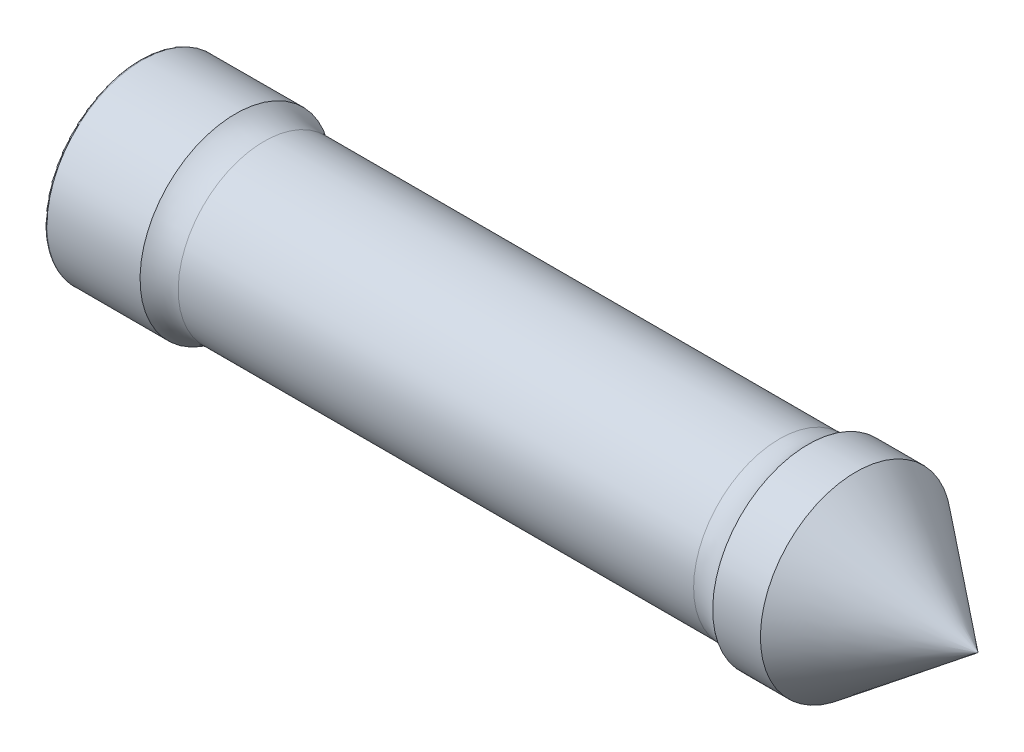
ISO-10303-21;
HEADER;
FILE_DESCRIPTION(('STEP AP214'),'2;1');
FILE_NAME('part.step','',(''),(''),'','','');
FILE_SCHEMA(('AUTOMOTIVE_DESIGN { 1 0 10303 214 1 1 1 1 }'));
ENDSEC;
DATA;
#1=APPLICATION_CONTEXT('core data for automotive mechanical design processes');
#2=APPLICATION_PROTOCOL_DEFINITION('international standard','automotive_design',2000,#1);
#3=PRODUCT_CONTEXT('',#1,'mechanical');
#4=PRODUCT('Part','Part','',(#3));
#5=PRODUCT_RELATED_PRODUCT_CATEGORY('part','',(#4));
#6=PRODUCT_DEFINITION_FORMATION('','',#4);
#7=PRODUCT_DEFINITION_CONTEXT('part definition',#1,'design');
#8=PRODUCT_DEFINITION('design','',#6,#7);
#9=PRODUCT_DEFINITION_SHAPE('','',#8);
#10=(LENGTH_UNIT() NAMED_UNIT(*) SI_UNIT(.MILLI.,.METRE.));
#11=(NAMED_UNIT(*) PLANE_ANGLE_UNIT() SI_UNIT($,.RADIAN.));
#12=(NAMED_UNIT(*) SI_UNIT($,.STERADIAN.) SOLID_ANGLE_UNIT());
#13=UNCERTAINTY_MEASURE_WITH_UNIT(LENGTH_MEASURE(1.E-05),#10,'distance_accuracy_value','');
#14=(GEOMETRIC_REPRESENTATION_CONTEXT(3) GLOBAL_UNCERTAINTY_ASSIGNED_CONTEXT((#13)) GLOBAL_UNIT_ASSIGNED_CONTEXT((#10,
#11,#12)) REPRESENTATION_CONTEXT('',''));
#15=CARTESIAN_POINT('',(0.,0.,0.));
#16=DIRECTION('',(0.,0.,1.));
#17=DIRECTION('',(1.,0.,0.));
#18=AXIS2_PLACEMENT_3D('',#15,#16,#17);
#19=CARTESIAN_POINT('',(0.,0.,0.));
#20=DIRECTION('',(1.,0.,0.));
#21=DIRECTION('',(0.,1.,0.));
#22=AXIS2_PLACEMENT_3D('',#19,#20,#21);
#23=PLANE('',#22);
#24=CARTESIAN_POINT('',(0.,0.,0.));
#25=DIRECTION('',(1.,0.,0.));
#26=DIRECTION('',(0.,1.,0.));
#27=AXIS2_PLACEMENT_3D('',#24,#25,#26);
#28=CIRCLE('',#27,19.5);
#29=CARTESIAN_POINT('',(0.,19.5,0.));
#30=VERTEX_POINT('',#29);
#31=EDGE_CURVE('E114',#30,#30,#28,.F.);
#32=ORIENTED_EDGE('',*,*,#31,.T.);
#33=EDGE_LOOP('',(#32));
#34=FACE_BOUND('',#33,.T.);
#35=CARTESIAN_POINT('',(0.,0.,0.));
#36=DIRECTION('',(-1.,0.,0.));
#37=DIRECTION('',(0.,0.,1.));
#38=AXIS2_PLACEMENT_3D('',#35,#36,#37);
#39=CIRCLE('',#38,16.);
#40=CARTESIAN_POINT('',(0.,0.,16.));
#41=VERTEX_POINT('',#40);
#42=EDGE_CURVE('E88',#41,#41,#39,.T.);
#43=ORIENTED_EDGE('',*,*,#42,.F.);
#44=EDGE_LOOP('',(#43));
#45=FACE_BOUND('',#44,.T.);
#46=ADVANCED_FACE('F57',(#34,#45),#23,.F.);
#47=CARTESIAN_POINT('',(0.,0.,0.));
#48=DIRECTION('',(-1.,0.,0.));
#49=DIRECTION('',(0.,-1.,0.));
#50=AXIS2_PLACEMENT_3D('',#47,#48,#49);
#51=CYLINDRICAL_SURFACE('',#50,20.);
#52=CARTESIAN_POINT('',(0.500000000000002,0.,0.));
#53=DIRECTION('',(1.,0.,0.));
#54=DIRECTION('',(0.,1.,0.));
#55=AXIS2_PLACEMENT_3D('',#52,#53,#54);
#56=CIRCLE('',#55,20.);
#57=CARTESIAN_POINT('',(0.499999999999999,20.,0.));
#58=VERTEX_POINT('',#57);
#59=EDGE_CURVE('E109',#58,#58,#56,.T.);
#60=ORIENTED_EDGE('',*,*,#59,.T.);
#61=EDGE_LOOP('',(#60));
#62=FACE_BOUND('',#61,.T.);
#63=CARTESIAN_POINT('',(20.,0.,0.));
#64=DIRECTION('',(-1.,0.,0.));
#65=DIRECTION('',(0.,-1.,0.));
#66=AXIS2_PLACEMENT_3D('',#63,#64,#65);
#67=CIRCLE('',#66,20.);
#68=CARTESIAN_POINT('',(20.,-20.,0.));
#69=VERTEX_POINT('',#68);
#70=EDGE_CURVE('E129',#69,#69,#67,.T.);
#71=ORIENTED_EDGE('',*,*,#70,.T.);
#72=EDGE_LOOP('',(#71));
#73=FACE_BOUND('',#72,.T.);
#74=ADVANCED_FACE('F160',(#62,#73),#51,.T.);
#75=CARTESIAN_POINT('',(0.,0.,0.));
#76=DIRECTION('',(-1.,0.,0.));
#77=DIRECTION('',(0.,-1.,0.));
#78=AXIS2_PLACEMENT_3D('',#75,#76,#77);
#79=CYLINDRICAL_SURFACE('',#78,18.);
#80=CARTESIAN_POINT('',(134.,0.,0.));
#81=DIRECTION('',(1.,0.,0.));
#82=DIRECTION('',(0.,1.,0.));
#83=AXIS2_PLACEMENT_3D('',#80,#81,#82);
#84=CIRCLE('',#83,18.);
#85=CARTESIAN_POINT('',(134.,18.,0.));
#86=VERTEX_POINT('',#85);
#87=EDGE_CURVE('E12',#86,#86,#84,.F.);
#88=ORIENTED_EDGE('',*,*,#87,.T.);
#89=EDGE_LOOP('',(#88));
#90=FACE_BOUND('',#89,.T.);
#91=CARTESIAN_POINT('',(26.,0.,0.));
#92=DIRECTION('',(-1.,0.,0.));
#93=DIRECTION('',(0.,-1.,0.));
#94=AXIS2_PLACEMENT_3D('',#91,#92,#93);
#95=CIRCLE('',#94,18.);
#96=CARTESIAN_POINT('',(26.,-18.,0.));
#97=VERTEX_POINT('',#96);
#98=EDGE_CURVE('E63',#97,#97,#95,.F.);
#99=ORIENTED_EDGE('',*,*,#98,.T.);
#100=EDGE_LOOP('',(#99));
#101=FACE_BOUND('',#100,.T.);
#102=ADVANCED_FACE('F122',(#90,#101),#79,.T.);
#103=CARTESIAN_POINT('',(0.,0.,0.));
#104=DIRECTION('',(-1.,0.,0.));
#105=DIRECTION('',(0.,-1.,0.));
#106=AXIS2_PLACEMENT_3D('',#103,#104,#105);
#107=CYLINDRICAL_SURFACE('',#106,20.);
#108=CARTESIAN_POINT('',(140.,0.,0.));
#109=DIRECTION('',(-1.,0.,0.));
#110=DIRECTION('',(0.,-1.,0.));
#111=AXIS2_PLACEMENT_3D('',#108,#109,#110);
#112=CIRCLE('',#111,20.);
#113=CARTESIAN_POINT('',(140.,-20.,0.));
#114=VERTEX_POINT('',#113);
#115=EDGE_CURVE('E101',#114,#114,#112,.T.);
#116=ORIENTED_EDGE('',*,*,#115,.F.);
#117=EDGE_LOOP('',(#116));
#118=FACE_BOUND('',#117,.T.);
#119=CARTESIAN_POINT('',(150.,0.,0.));
#120=DIRECTION('',(-1.,0.,0.));
#121=DIRECTION('',(0.,-1.,0.));
#122=AXIS2_PLACEMENT_3D('',#119,#120,#121);
#123=CIRCLE('',#122,20.);
#124=CARTESIAN_POINT('',(150.,-19.9999999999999,0.));
#125=VERTEX_POINT('',#124);
#126=EDGE_CURVE('E84',#125,#125,#123,.T.);
#127=ORIENTED_EDGE('',*,*,#126,.T.);
#128=EDGE_LOOP('',(#127));
#129=FACE_BOUND('',#128,.T.);
#130=ADVANCED_FACE('F140',(#118,#129),#107,.T.);
#131=CARTESIAN_POINT('',(175.566322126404,0.,0.));
#132=DIRECTION('',(-1.,0.,0.));
#133=DIRECTION('',(0.,-1.,0.));
#134=AXIS2_PLACEMENT_3D('',#131,#132,#133);
#135=CONICAL_SURFACE('',#134,0.0254,0.663225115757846);
#136=CARTESIAN_POINT('',(175.566322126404,0.,0.));
#137=DIRECTION('',(-1.,0.,0.));
#138=DIRECTION('',(0.,-1.,0.));
#139=AXIS2_PLACEMENT_3D('',#136,#137,#138);
#140=CIRCLE('',#139,0.0254);
#141=CARTESIAN_POINT('',(175.566322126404,-0.0253999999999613,0.));
#142=VERTEX_POINT('',#141);
#143=EDGE_CURVE('E76',#142,#142,#140,.T.);
#144=CARTESIAN_POINT('',(150.,-19.9999999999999,0.));
#145=CARTESIAN_POINT('',(150.266315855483,-19.7919312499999,0.));
#146=CARTESIAN_POINT('',(150.532631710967,-19.5838624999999,0.));
#147=CARTESIAN_POINT('',(151.065263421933,-19.1677249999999,0.));
#148=CARTESIAN_POINT('',(151.331579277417,-18.9596562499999,0.));
#149=CARTESIAN_POINT('',(151.864210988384,-18.5435187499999,0.));
#150=CARTESIAN_POINT('',(152.130526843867,-18.3354499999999,0.));
#151=CARTESIAN_POINT('',(152.663158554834,-17.9193124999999,0.));
#152=CARTESIAN_POINT('',(152.929474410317,-17.7112437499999,0.));
#153=CARTESIAN_POINT('',(153.462106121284,-17.2951062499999,0.));
#154=CARTESIAN_POINT('',(153.728421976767,-17.0870374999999,0.));
#155=CARTESIAN_POINT('',(154.261053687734,-16.6708999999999,0.));
#156=CARTESIAN_POINT('',(154.527369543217,-16.4628312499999,0.));
#157=CARTESIAN_POINT('',(155.060001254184,-16.0466937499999,0.));
#158=CARTESIAN_POINT('',(155.326317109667,-15.8386249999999,0.));
#159=CARTESIAN_POINT('',(155.858948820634,-15.4224874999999,0.));
#160=CARTESIAN_POINT('',(156.125264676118,-15.2144187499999,0.));
#161=CARTESIAN_POINT('',(156.657896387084,-14.7982812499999,0.));
#162=CARTESIAN_POINT('',(156.924212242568,-14.5902124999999,0.));
#163=CARTESIAN_POINT('',(157.456843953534,-14.1740749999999,0.));
#164=CARTESIAN_POINT('',(157.723159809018,-13.9660062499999,0.));
#165=CARTESIAN_POINT('',(158.255791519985,-13.54986875,0.));
#166=CARTESIAN_POINT('',(158.522107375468,-13.3418,0.));
#167=CARTESIAN_POINT('',(159.054739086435,-12.9256624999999,0.));
#168=CARTESIAN_POINT('',(159.321054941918,-12.7175937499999,0.));
#169=CARTESIAN_POINT('',(159.853686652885,-12.3014562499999,0.));
#170=CARTESIAN_POINT('',(160.120002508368,-12.0933875,0.));
#171=CARTESIAN_POINT('',(160.652634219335,-11.67725,0.));
#172=CARTESIAN_POINT('',(160.918950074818,-11.46918125,0.));
#173=CARTESIAN_POINT('',(161.451581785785,-11.0530437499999,0.));
#174=CARTESIAN_POINT('',(161.717897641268,-10.844975,0.));
#175=CARTESIAN_POINT('',(162.250529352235,-10.4288375,0.));
#176=CARTESIAN_POINT('',(162.516845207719,-10.22076875,0.));
#177=CARTESIAN_POINT('',(163.049476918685,-9.80463124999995,0.));
#178=CARTESIAN_POINT('',(163.315792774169,-9.59656249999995,0.));
#179=CARTESIAN_POINT('',(163.848424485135,-9.18042499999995,0.));
#180=CARTESIAN_POINT('',(164.114740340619,-8.97235624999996,0.));
#181=CARTESIAN_POINT('',(164.647372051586,-8.55621874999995,0.));
#182=CARTESIAN_POINT('',(164.913687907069,-8.34814999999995,0.));
#183=CARTESIAN_POINT('',(165.446319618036,-7.93201249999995,0.));
#184=CARTESIAN_POINT('',(165.712635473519,-7.72394374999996,0.));
#185=CARTESIAN_POINT('',(166.245267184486,-7.30780624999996,0.));
#186=CARTESIAN_POINT('',(166.511583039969,-7.09973749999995,0.));
#187=CARTESIAN_POINT('',(167.044214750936,-6.68359999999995,0.));
#188=CARTESIAN_POINT('',(167.310530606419,-6.47553124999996,0.));
#189=CARTESIAN_POINT('',(167.843162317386,-6.05939374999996,0.));
#190=CARTESIAN_POINT('',(168.109478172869,-5.85132499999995,0.));
#191=CARTESIAN_POINT('',(168.642109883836,-5.43518749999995,0.));
#192=CARTESIAN_POINT('',(168.908425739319,-5.22711874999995,0.));
#193=CARTESIAN_POINT('',(169.441057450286,-4.81098124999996,0.));
#194=CARTESIAN_POINT('',(169.70737330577,-4.60291249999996,0.));
#195=CARTESIAN_POINT('',(170.240005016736,-4.18677499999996,0.));
#196=CARTESIAN_POINT('',(170.50632087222,-3.97870624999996,0.));
#197=CARTESIAN_POINT('',(171.038952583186,-3.56256874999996,0.));
#198=CARTESIAN_POINT('',(171.30526843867,-3.35449999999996,0.));
#199=CARTESIAN_POINT('',(171.837900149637,-2.93836249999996,0.));
#200=CARTESIAN_POINT('',(172.10421600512,-2.73029374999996,0.));
#201=CARTESIAN_POINT('',(172.636847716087,-2.31415624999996,0.));
#202=CARTESIAN_POINT('',(172.90316357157,-2.10608749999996,0.));
#203=CARTESIAN_POINT('',(173.435795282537,-1.68994999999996,0.));
#204=CARTESIAN_POINT('',(173.70211113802,-1.48188124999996,0.));
#205=CARTESIAN_POINT('',(174.234742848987,-1.06574374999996,0.));
#206=CARTESIAN_POINT('',(174.50105870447,-0.857674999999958,0.));
#207=CARTESIAN_POINT('',(175.033690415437,-0.441537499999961,0.));
#208=CARTESIAN_POINT('',(175.30000627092,-0.233468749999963,0.));
#209=CARTESIAN_POINT('',(175.566322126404,-0.0253999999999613,0.));
#210=B_SPLINE_CURVE_WITH_KNOTS('',3,(#144,#145,#146,#147,#148,#149,#150,#151,#152,#153,#154,
#155,#156,#157,#158,#159,#160,#161,#162,#163,#164,#165,#166,#167,#168,#169,#170,#171,#172,#173,
#174,#175,#176,#177,#178,#179,#180,#181,#182,#183,#184,#185,#186,#187,#188,#189,#190,#191,#192,
#193,#194,#195,#196,#197,#198,#199,#200,#201,#202,#203,#204,#205,#206,#207,#208,#209),
.UNSPECIFIED.,.F.,.F.,(4,2,2,2,2,2,2,2,2,2,2,2,2,2,2,2,2,2,2,2,2,2,2,2,2,2,2,2,2,2,2,2,4),(0.,
1.0138790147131,2.02775802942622,3.04163704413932,4.05551605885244,5.06939507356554,
6.08327408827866,7.09715310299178,8.11103211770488,9.12491113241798,10.1387901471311,
11.1526691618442,12.1665481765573,13.1804271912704,14.1943062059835,15.2081852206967,
16.2220642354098,17.2359432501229,18.249822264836,19.2637012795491,20.2775802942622,
21.2914593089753,22.3053383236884,23.3192173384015,24.3330963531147,25.3469753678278,
26.3608543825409,27.374733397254,28.3886124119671,29.4024914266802,30.4163704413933,
31.4302494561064,32.4441284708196),.UNSPECIFIED.);
#211=EDGE_CURVE('BSEAM145',#125,#142,#210,.T.);
#212=ORIENTED_EDGE('',*,*,#126,.F.);
#213=ORIENTED_EDGE('',*,*,#143,.T.);
#214=ORIENTED_EDGE('',*,*,#211,.T.);
#215=ORIENTED_EDGE('',*,*,#211,.F.);
#216=EDGE_LOOP('',(#212,#214,#213,#215));
#217=FACE_BOUND('',#216,.T.);
#218=ADVANCED_FACE('F145',(#217),#135,.T.);
#219=CARTESIAN_POINT('',(175.566322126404,0.0254000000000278,0.));
#220=DIRECTION('',(-1.,0.,0.));
#221=DIRECTION('',(0.,-1.,0.));
#222=AXIS2_PLACEMENT_3D('',#219,#220,#221);
#223=PLANE('',#222);
#224=ORIENTED_EDGE('',*,*,#143,.F.);
#225=EDGE_LOOP('',(#224));
#226=FACE_BOUND('',#225,.T.);
#227=ADVANCED_FACE('F73',(#226),#223,.F.);
#228=CARTESIAN_POINT('',(150.,0.,0.));
#229=DIRECTION('',(-1.,0.,0.));
#230=DIRECTION('',(0.,0.,1.));
#231=AXIS2_PLACEMENT_3D('',#228,#229,#230);
#232=CONICAL_SURFACE('',#231,15.,1.02974425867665);
#233=CARTESIAN_POINT('',(159.012909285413,0.,0.));
#234=VERTEX_POINT('',#233);
#235=VERTEX_LOOP('',#234);
#236=FACE_BOUND('',#235,.T.);
#237=CARTESIAN_POINT('',(150.,0.,0.));
#238=DIRECTION('',(-1.,0.,0.));
#239=DIRECTION('',(0.,0.,1.));
#240=AXIS2_PLACEMENT_3D('',#237,#238,#239);
#241=CIRCLE('',#240,15.);
#242=CARTESIAN_POINT('',(150.,0.,15.));
#243=VERTEX_POINT('',#242);
#244=EDGE_CURVE('E71',#243,#243,#241,.T.);
#245=ORIENTED_EDGE('',*,*,#244,.T.);
#246=EDGE_LOOP('',(#245));
#247=FACE_BOUND('',#246,.T.);
#248=ADVANCED_FACE('F70',(#236,#247),#232,.F.);
#249=CARTESIAN_POINT('',(0.,0.,0.));
#250=DIRECTION('',(-1.,0.,0.));
#251=DIRECTION('',(0.,0.,1.));
#252=AXIS2_PLACEMENT_3D('',#249,#250,#251);
#253=CYLINDRICAL_SURFACE('',#252,15.);
#254=ORIENTED_EDGE('',*,*,#244,.F.);
#255=EDGE_LOOP('',(#254));
#256=FACE_BOUND('',#255,.T.);
#257=CARTESIAN_POINT('',(1.,0.,0.));
#258=DIRECTION('',(-1.,0.,0.));
#259=DIRECTION('',(0.,0.,1.));
#260=AXIS2_PLACEMENT_3D('',#257,#258,#259);
#261=CIRCLE('',#260,15.);
#262=CARTESIAN_POINT('',(1.,0.,15.));
#263=VERTEX_POINT('',#262);
#264=EDGE_CURVE('E79',#263,#263,#261,.T.);
#265=ORIENTED_EDGE('',*,*,#264,.T.);
#266=EDGE_LOOP('',(#265));
#267=FACE_BOUND('',#266,.T.);
#268=ADVANCED_FACE('F67',(#256,#267),#253,.F.);
#269=CARTESIAN_POINT('',(0.,0.,0.));
#270=DIRECTION('',(-1.,0.,0.));
#271=DIRECTION('',(0.,0.,1.));
#272=AXIS2_PLACEMENT_3D('',#269,#270,#271);
#273=CONICAL_SURFACE('',#272,16.,0.785398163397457);
#274=ORIENTED_EDGE('',*,*,#264,.F.);
#275=EDGE_LOOP('',(#274));
#276=FACE_BOUND('',#275,.T.);
#277=ORIENTED_EDGE('',*,*,#42,.T.);
#278=EDGE_LOOP('',(#277));
#279=FACE_BOUND('',#278,.T.);
#280=ADVANCED_FACE('F167',(#276,#279),#273,.F.);
#281=CARTESIAN_POINT('',(0.500000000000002,0.,0.));
#282=DIRECTION('',(1.,0.,0.));
#283=DIRECTION('',(0.,1.,0.));
#284=AXIS2_PLACEMENT_3D('',#281,#282,#283);
#285=TOROIDAL_SURFACE('',#284,19.5,0.5);
#286=ORIENTED_EDGE('',*,*,#59,.F.);
#287=EDGE_LOOP('',(#286));
#288=FACE_BOUND('',#287,.T.);
#289=ORIENTED_EDGE('',*,*,#31,.F.);
#290=EDGE_LOOP('',(#289));
#291=FACE_BOUND('',#290,.T.);
#292=ADVANCED_FACE('F166',(#288,#291),#285,.T.);
#293=CARTESIAN_POINT('',(134.,0.,0.));
#294=DIRECTION('',(1.,0.,0.));
#295=DIRECTION('',(0.,1.,0.));
#296=AXIS2_PLACEMENT_3D('',#293,#294,#295);
#297=TOROIDAL_SURFACE('',#296,28.,10.);
#298=ORIENTED_EDGE('',*,*,#115,.T.);
#299=EDGE_LOOP('',(#298));
#300=FACE_BOUND('',#299,.T.);
#301=ORIENTED_EDGE('',*,*,#87,.F.);
#302=EDGE_LOOP('',(#301));
#303=FACE_BOUND('',#302,.T.);
#304=ADVANCED_FACE('F123',(#300,#303),#297,.F.);
#305=CARTESIAN_POINT('',(26.,0.,0.));
#306=DIRECTION('',(-1.,0.,0.));
#307=DIRECTION('',(0.,-1.,0.));
#308=AXIS2_PLACEMENT_3D('',#305,#306,#307);
#309=TOROIDAL_SURFACE('',#308,28.,10.);
#310=ORIENTED_EDGE('',*,*,#98,.F.);
#311=EDGE_LOOP('',(#310));
#312=FACE_BOUND('',#311,.T.);
#313=ORIENTED_EDGE('',*,*,#70,.F.);
#314=EDGE_LOOP('',(#313));
#315=FACE_BOUND('',#314,.T.);
#316=ADVANCED_FACE('F59',(#312,#315),#309,.F.);
#317=CLOSED_SHELL('',(#46,#74,#102,#130,#218,#227,#248,#268,#280,#292,#304,#316));
#318=MANIFOLD_SOLID_BREP('B2',#317);
#319=ADVANCED_BREP_SHAPE_REPRESENTATION('',(#18,#318),#14);
#320=SHAPE_DEFINITION_REPRESENTATION(#9,#319);
ENDSEC;
END-ISO-10303-21;
